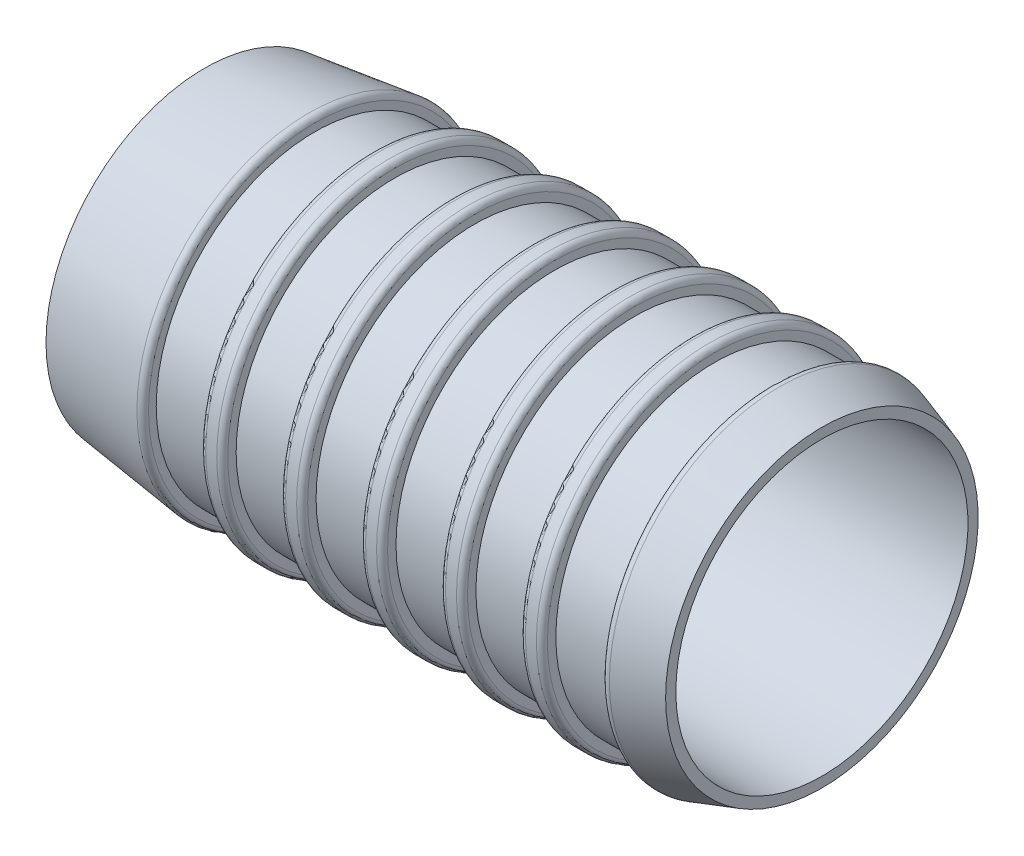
ISO-10303-21;
HEADER;
FILE_DESCRIPTION(('STEP AP214'),'2;1');
FILE_NAME('part.step','',(''),(''),'','','');
FILE_SCHEMA(('AUTOMOTIVE_DESIGN { 1 0 10303 214 1 1 1 1 }'));
ENDSEC;
DATA;
#1=APPLICATION_CONTEXT('core data for automotive mechanical design processes');
#2=APPLICATION_PROTOCOL_DEFINITION('international standard','automotive_design',2000,#1);
#3=PRODUCT_CONTEXT('',#1,'mechanical');
#4=PRODUCT('Part','Part','',(#3));
#5=PRODUCT_RELATED_PRODUCT_CATEGORY('part','',(#4));
#6=PRODUCT_DEFINITION_FORMATION('','',#4);
#7=PRODUCT_DEFINITION_CONTEXT('part definition',#1,'design');
#8=PRODUCT_DEFINITION('design','',#6,#7);
#9=PRODUCT_DEFINITION_SHAPE('','',#8);
#10=(LENGTH_UNIT() NAMED_UNIT(*) SI_UNIT(.MILLI.,.METRE.));
#11=(NAMED_UNIT(*) PLANE_ANGLE_UNIT() SI_UNIT($,.RADIAN.));
#12=(NAMED_UNIT(*) SI_UNIT($,.STERADIAN.) SOLID_ANGLE_UNIT());
#13=UNCERTAINTY_MEASURE_WITH_UNIT(LENGTH_MEASURE(1.E-05),#10,'distance_accuracy_value','');
#14=(GEOMETRIC_REPRESENTATION_CONTEXT(3) GLOBAL_UNCERTAINTY_ASSIGNED_CONTEXT((#13)) GLOBAL_UNIT_ASSIGNED_CONTEXT((#10,
#11,#12)) REPRESENTATION_CONTEXT('',''));
#15=CARTESIAN_POINT('',(0.,0.,0.));
#16=DIRECTION('',(0.,0.,1.));
#17=DIRECTION('',(1.,0.,0.));
#18=AXIS2_PLACEMENT_3D('',#15,#16,#17);
#19=CARTESIAN_POINT('',(-10.0868830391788,26.5,0.));
#20=DIRECTION('',(1.,0.,0.));
#21=DIRECTION('',(0.,0.,-1.));
#22=AXIS2_PLACEMENT_3D('',#19,#20,#21);
#23=PLANE('',#22);
#24=CARTESIAN_POINT('',(-10.0868830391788,0.,0.));
#25=DIRECTION('',(-1.,0.,0.));
#26=DIRECTION('',(0.,0.,1.));
#27=AXIS2_PLACEMENT_3D('',#24,#25,#26);
#28=CIRCLE('',#27,26.5);
#29=CARTESIAN_POINT('',(-10.0868830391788,0.,26.5));
#30=VERTEX_POINT('',#29);
#31=EDGE_CURVE('E150',#30,#30,#28,.T.);
#32=ORIENTED_EDGE('',*,*,#31,.F.);
#33=EDGE_LOOP('',(#32));
#34=FACE_BOUND('',#33,.T.);
#35=CARTESIAN_POINT('',(-10.0868830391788,0.,0.));
#36=DIRECTION('',(-1.,0.,0.));
#37=DIRECTION('',(0.,0.,1.));
#38=AXIS2_PLACEMENT_3D('',#35,#36,#37);
#39=CIRCLE('',#38,28.769640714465);
#40=CARTESIAN_POINT('',(-10.0868830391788,0.,28.769640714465));
#41=VERTEX_POINT('',#40);
#42=EDGE_CURVE('E105',#41,#41,#39,.T.);
#43=ORIENTED_EDGE('',*,*,#42,.T.);
#44=EDGE_LOOP('',(#43));
#45=FACE_BOUND('',#44,.T.);
#46=ADVANCED_FACE('F26',(#34,#45),#23,.F.);
#47=CARTESIAN_POINT('',(9.91311696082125,0.,0.));
#48=DIRECTION('',(1.,0.,0.));
#49=DIRECTION('',(0.,0.,-1.));
#50=AXIS2_PLACEMENT_3D('',#47,#48,#49);
#51=CONICAL_SURFACE('',#50,31.2948133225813,0.125594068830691);
#52=CARTESIAN_POINT('',(8.78785281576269,0.,0.));
#53=DIRECTION('',(-1.,0.,0.));
#54=DIRECTION('',(0.,0.,1.));
#55=AXIS2_PLACEMENT_3D('',#52,#53,#54);
#56=CIRCLE('',#55,31.1527390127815);
#57=CARTESIAN_POINT('',(8.78785281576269,0.,31.1527390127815));
#58=VERTEX_POINT('',#57);
#59=EDGE_CURVE('E32',#58,#58,#56,.T.);
#60=ORIENTED_EDGE('',*,*,#59,.T.);
#61=EDGE_LOOP('',(#60));
#62=FACE_BOUND('',#61,.T.);
#63=ORIENTED_EDGE('',*,*,#42,.F.);
#64=EDGE_LOOP('',(#63));
#65=FACE_BOUND('',#64,.T.);
#66=ADVANCED_FACE('F158',(#62,#65),#51,.T.);
#67=CARTESIAN_POINT('',(9.91311696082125,31.2948133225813,0.));
#68=DIRECTION('',(-1.,0.,0.));
#69=DIRECTION('',(0.,0.,1.));
#70=AXIS2_PLACEMENT_3D('',#67,#68,#69);
#71=PLANE('',#70);
#72=CARTESIAN_POINT('',(9.91311696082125,0.,0.));
#73=DIRECTION('',(-1.,0.,0.));
#74=DIRECTION('',(0.,0.,1.));
#75=AXIS2_PLACEMENT_3D('',#72,#73,#74);
#76=CIRCLE('',#75,30.1606155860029);
#77=CARTESIAN_POINT('',(9.91311696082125,0.,30.1606155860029));
#78=VERTEX_POINT('',#77);
#79=EDGE_CURVE('E10',#78,#78,#76,.F.);
#80=ORIENTED_EDGE('',*,*,#79,.T.);
#81=EDGE_LOOP('',(#80));
#82=FACE_BOUND('',#81,.T.);
#83=CARTESIAN_POINT('',(9.91311696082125,0.,0.));
#84=DIRECTION('',(-1.,0.,0.));
#85=DIRECTION('',(0.,0.,1.));
#86=AXIS2_PLACEMENT_3D('',#83,#84,#85);
#87=CIRCLE('',#86,28.769640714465);
#88=CARTESIAN_POINT('',(9.91311696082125,0.,28.769640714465));
#89=VERTEX_POINT('',#88);
#90=EDGE_CURVE('E108',#89,#89,#87,.T.);
#91=ORIENTED_EDGE('',*,*,#90,.T.);
#92=EDGE_LOOP('',(#91));
#93=FACE_BOUND('',#92,.T.);
#94=ADVANCED_FACE('F162',(#82,#93),#71,.F.);
#95=CARTESIAN_POINT('',(0.,0.,0.));
#96=DIRECTION('',(-1.,0.,0.));
#97=DIRECTION('',(0.,0.,1.));
#98=AXIS2_PLACEMENT_3D('',#95,#96,#97);
#99=CYLINDRICAL_SURFACE('',#98,28.769640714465);
#100=ORIENTED_EDGE('',*,*,#90,.F.);
#101=EDGE_LOOP('',(#100));
#102=FACE_BOUND('',#101,.T.);
#103=CARTESIAN_POINT('',(20.4131169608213,0.,0.));
#104=DIRECTION('',(-1.,0.,0.));
#105=DIRECTION('',(0.,0.,1.));
#106=AXIS2_PLACEMENT_3D('',#103,#104,#105);
#107=CIRCLE('',#106,28.769640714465);
#108=CARTESIAN_POINT('',(20.4131169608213,0.,28.769640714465));
#109=VERTEX_POINT('',#108);
#110=EDGE_CURVE('E111',#109,#109,#107,.T.);
#111=ORIENTED_EDGE('',*,*,#110,.T.);
#112=EDGE_LOOP('',(#111));
#113=FACE_BOUND('',#112,.T.);
#114=ADVANCED_FACE('F167',(#102,#113),#99,.T.);
#115=CARTESIAN_POINT('',(20.4131169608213,28.769640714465,0.));
#116=DIRECTION('',(1.,0.,0.));
#117=DIRECTION('',(0.,0.,-1.));
#118=AXIS2_PLACEMENT_3D('',#115,#116,#117);
#119=PLANE('',#118);
#120=CARTESIAN_POINT('',(20.4131169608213,0.,0.));
#121=DIRECTION('',(1.,0.,0.));
#122=DIRECTION('',(0.,0.,-1.));
#123=AXIS2_PLACEMENT_3D('',#120,#121,#122);
#124=CIRCLE('',#123,30.2948133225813);
#125=CARTESIAN_POINT('',(20.4131169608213,0.,-30.2948133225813));
#126=VERTEX_POINT('',#125);
#127=EDGE_CURVE('E45',#126,#126,#124,.F.);
#128=ORIENTED_EDGE('',*,*,#127,.T.);
#129=EDGE_LOOP('',(#128));
#130=FACE_BOUND('',#129,.T.);
#131=ORIENTED_EDGE('',*,*,#110,.F.);
#132=EDGE_LOOP('',(#131));
#133=FACE_BOUND('',#132,.T.);
#134=ADVANCED_FACE('F172',(#130,#133),#119,.F.);
#135=CARTESIAN_POINT('',(0.,0.,0.));
#136=DIRECTION('',(-1.,0.,0.));
#137=DIRECTION('',(0.,0.,1.));
#138=AXIS2_PLACEMENT_3D('',#135,#136,#137);
#139=CYLINDRICAL_SURFACE('',#138,31.2948133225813);
#140=CARTESIAN_POINT('',(23.4131169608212,0.,0.));
#141=DIRECTION('',(-1.,0.,0.));
#142=DIRECTION('',(0.,0.,1.));
#143=AXIS2_PLACEMENT_3D('',#140,#141,#142);
#144=CIRCLE('',#143,31.2948133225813);
#145=CARTESIAN_POINT('',(23.4131169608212,0.,31.2948133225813));
#146=VERTEX_POINT('',#145);
#147=EDGE_CURVE('E51',#146,#146,#144,.T.);
#148=ORIENTED_EDGE('',*,*,#147,.T.);
#149=EDGE_LOOP('',(#148));
#150=FACE_BOUND('',#149,.T.);
#151=CARTESIAN_POINT('',(21.4131169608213,0.,0.));
#152=DIRECTION('',(1.,0.,0.));
#153=DIRECTION('',(0.,0.,-1.));
#154=AXIS2_PLACEMENT_3D('',#151,#152,#153);
#155=CIRCLE('',#154,31.2948133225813);
#156=CARTESIAN_POINT('',(21.4131169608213,0.,-31.2948133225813));
#157=VERTEX_POINT('',#156);
#158=EDGE_CURVE('E54',#157,#157,#155,.T.);
#159=ORIENTED_EDGE('',*,*,#158,.T.);
#160=EDGE_LOOP('',(#159));
#161=FACE_BOUND('',#160,.T.);
#162=ADVANCED_FACE('F176',(#150,#161),#139,.T.);
#163=CARTESIAN_POINT('',(24.4131169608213,31.2948133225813,0.));
#164=DIRECTION('',(-1.,0.,0.));
#165=DIRECTION('',(0.,0.,1.));
#166=AXIS2_PLACEMENT_3D('',#163,#164,#165);
#167=PLANE('',#166);
#168=CARTESIAN_POINT('',(24.4131169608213,0.,0.));
#169=DIRECTION('',(-1.,0.,0.));
#170=DIRECTION('',(0.,0.,1.));
#171=AXIS2_PLACEMENT_3D('',#168,#169,#170);
#172=CIRCLE('',#171,30.2948133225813);
#173=CARTESIAN_POINT('',(24.4131169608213,0.,30.2948133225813));
#174=VERTEX_POINT('',#173);
#175=EDGE_CURVE('E48',#174,#174,#172,.F.);
#176=ORIENTED_EDGE('',*,*,#175,.T.);
#177=EDGE_LOOP('',(#176));
#178=FACE_BOUND('',#177,.T.);
#179=CARTESIAN_POINT('',(24.4131169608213,0.,0.));
#180=DIRECTION('',(-1.,0.,0.));
#181=DIRECTION('',(0.,0.,1.));
#182=AXIS2_PLACEMENT_3D('',#179,#180,#181);
#183=CIRCLE('',#182,28.769640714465);
#184=CARTESIAN_POINT('',(24.4131169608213,0.,28.769640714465));
#185=VERTEX_POINT('',#184);
#186=EDGE_CURVE('E114',#185,#185,#183,.T.);
#187=ORIENTED_EDGE('',*,*,#186,.T.);
#188=EDGE_LOOP('',(#187));
#189=FACE_BOUND('',#188,.T.);
#190=ADVANCED_FACE('F180',(#178,#189),#167,.F.);
#191=CARTESIAN_POINT('',(0.,0.,0.));
#192=DIRECTION('',(-1.,0.,0.));
#193=DIRECTION('',(0.,0.,1.));
#194=AXIS2_PLACEMENT_3D('',#191,#192,#193);
#195=CYLINDRICAL_SURFACE('',#194,28.769640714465);
#196=ORIENTED_EDGE('',*,*,#186,.F.);
#197=EDGE_LOOP('',(#196));
#198=FACE_BOUND('',#197,.T.);
#199=CARTESIAN_POINT('',(34.9131169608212,0.,0.));
#200=DIRECTION('',(-1.,0.,0.));
#201=DIRECTION('',(0.,0.,1.));
#202=AXIS2_PLACEMENT_3D('',#199,#200,#201);
#203=CIRCLE('',#202,28.769640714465);
#204=CARTESIAN_POINT('',(34.9131169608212,0.,28.769640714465));
#205=VERTEX_POINT('',#204);
#206=EDGE_CURVE('E117',#205,#205,#203,.T.);
#207=ORIENTED_EDGE('',*,*,#206,.T.);
#208=EDGE_LOOP('',(#207));
#209=FACE_BOUND('',#208,.T.);
#210=ADVANCED_FACE('F184',(#198,#209),#195,.T.);
#211=CARTESIAN_POINT('',(34.9131169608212,28.769640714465,0.));
#212=DIRECTION('',(1.,0.,0.));
#213=DIRECTION('',(0.,0.,-1.));
#214=AXIS2_PLACEMENT_3D('',#211,#212,#213);
#215=PLANE('',#214);
#216=CARTESIAN_POINT('',(34.9131169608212,0.,0.));
#217=DIRECTION('',(1.,0.,0.));
#218=DIRECTION('',(0.,0.,-1.));
#219=AXIS2_PLACEMENT_3D('',#216,#217,#218);
#220=CIRCLE('',#219,30.2948133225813);
#221=CARTESIAN_POINT('',(34.9131169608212,0.,-30.2948133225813));
#222=VERTEX_POINT('',#221);
#223=EDGE_CURVE('E57',#222,#222,#220,.F.);
#224=ORIENTED_EDGE('',*,*,#223,.T.);
#225=EDGE_LOOP('',(#224));
#226=FACE_BOUND('',#225,.T.);
#227=ORIENTED_EDGE('',*,*,#206,.F.);
#228=EDGE_LOOP('',(#227));
#229=FACE_BOUND('',#228,.T.);
#230=ADVANCED_FACE('F188',(#226,#229),#215,.F.);
#231=CARTESIAN_POINT('',(0.,0.,0.));
#232=DIRECTION('',(-1.,0.,0.));
#233=DIRECTION('',(0.,0.,1.));
#234=AXIS2_PLACEMENT_3D('',#231,#232,#233);
#235=CYLINDRICAL_SURFACE('',#234,31.2948133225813);
#236=CARTESIAN_POINT('',(37.9131169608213,0.,0.));
#237=DIRECTION('',(-1.,0.,0.));
#238=DIRECTION('',(0.,0.,1.));
#239=AXIS2_PLACEMENT_3D('',#236,#237,#238);
#240=CIRCLE('',#239,31.2948133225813);
#241=CARTESIAN_POINT('',(37.9131169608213,0.,31.2948133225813));
#242=VERTEX_POINT('',#241);
#243=EDGE_CURVE('E63',#242,#242,#240,.T.);
#244=ORIENTED_EDGE('',*,*,#243,.T.);
#245=EDGE_LOOP('',(#244));
#246=FACE_BOUND('',#245,.T.);
#247=CARTESIAN_POINT('',(35.9131169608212,0.,0.));
#248=DIRECTION('',(1.,0.,0.));
#249=DIRECTION('',(0.,0.,-1.));
#250=AXIS2_PLACEMENT_3D('',#247,#248,#249);
#251=CIRCLE('',#250,31.2948133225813);
#252=CARTESIAN_POINT('',(35.9131169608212,0.,-31.2948133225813));
#253=VERTEX_POINT('',#252);
#254=EDGE_CURVE('E66',#253,#253,#251,.T.);
#255=ORIENTED_EDGE('',*,*,#254,.T.);
#256=EDGE_LOOP('',(#255));
#257=FACE_BOUND('',#256,.T.);
#258=ADVANCED_FACE('F192',(#246,#257),#235,.T.);
#259=CARTESIAN_POINT('',(38.9131169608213,31.2948133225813,0.));
#260=DIRECTION('',(-1.,0.,0.));
#261=DIRECTION('',(0.,0.,1.));
#262=AXIS2_PLACEMENT_3D('',#259,#260,#261);
#263=PLANE('',#262);
#264=CARTESIAN_POINT('',(38.9131169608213,0.,0.));
#265=DIRECTION('',(-1.,0.,0.));
#266=DIRECTION('',(0.,0.,1.));
#267=AXIS2_PLACEMENT_3D('',#264,#265,#266);
#268=CIRCLE('',#267,30.2948133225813);
#269=CARTESIAN_POINT('',(38.9131169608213,0.,30.2948133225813));
#270=VERTEX_POINT('',#269);
#271=EDGE_CURVE('E60',#270,#270,#268,.F.);
#272=ORIENTED_EDGE('',*,*,#271,.T.);
#273=EDGE_LOOP('',(#272));
#274=FACE_BOUND('',#273,.T.);
#275=CARTESIAN_POINT('',(38.9131169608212,0.,0.));
#276=DIRECTION('',(-1.,0.,0.));
#277=DIRECTION('',(0.,0.,1.));
#278=AXIS2_PLACEMENT_3D('',#275,#276,#277);
#279=CIRCLE('',#278,28.769640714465);
#280=CARTESIAN_POINT('',(38.9131169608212,0.,28.769640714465));
#281=VERTEX_POINT('',#280);
#282=EDGE_CURVE('E120',#281,#281,#279,.T.);
#283=ORIENTED_EDGE('',*,*,#282,.T.);
#284=EDGE_LOOP('',(#283));
#285=FACE_BOUND('',#284,.T.);
#286=ADVANCED_FACE('F196',(#274,#285),#263,.F.);
#287=CARTESIAN_POINT('',(0.,0.,0.));
#288=DIRECTION('',(-1.,0.,0.));
#289=DIRECTION('',(0.,0.,1.));
#290=AXIS2_PLACEMENT_3D('',#287,#288,#289);
#291=CYLINDRICAL_SURFACE('',#290,28.769640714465);
#292=ORIENTED_EDGE('',*,*,#282,.F.);
#293=EDGE_LOOP('',(#292));
#294=FACE_BOUND('',#293,.T.);
#295=CARTESIAN_POINT('',(49.4131169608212,0.,0.));
#296=DIRECTION('',(-1.,0.,0.));
#297=DIRECTION('',(0.,0.,1.));
#298=AXIS2_PLACEMENT_3D('',#295,#296,#297);
#299=CIRCLE('',#298,28.769640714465);
#300=CARTESIAN_POINT('',(49.4131169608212,0.,28.769640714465));
#301=VERTEX_POINT('',#300);
#302=EDGE_CURVE('E123',#301,#301,#299,.T.);
#303=ORIENTED_EDGE('',*,*,#302,.T.);
#304=EDGE_LOOP('',(#303));
#305=FACE_BOUND('',#304,.T.);
#306=ADVANCED_FACE('F200',(#294,#305),#291,.T.);
#307=CARTESIAN_POINT('',(49.4131169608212,28.769640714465,0.));
#308=DIRECTION('',(1.,0.,0.));
#309=DIRECTION('',(0.,0.,-1.));
#310=AXIS2_PLACEMENT_3D('',#307,#308,#309);
#311=PLANE('',#310);
#312=CARTESIAN_POINT('',(49.4131169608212,0.,0.));
#313=DIRECTION('',(1.,0.,0.));
#314=DIRECTION('',(0.,0.,-1.));
#315=AXIS2_PLACEMENT_3D('',#312,#313,#314);
#316=CIRCLE('',#315,30.2948133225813);
#317=CARTESIAN_POINT('',(49.4131169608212,0.,-30.2948133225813));
#318=VERTEX_POINT('',#317);
#319=EDGE_CURVE('E69',#318,#318,#316,.F.);
#320=ORIENTED_EDGE('',*,*,#319,.T.);
#321=EDGE_LOOP('',(#320));
#322=FACE_BOUND('',#321,.T.);
#323=ORIENTED_EDGE('',*,*,#302,.F.);
#324=EDGE_LOOP('',(#323));
#325=FACE_BOUND('',#324,.T.);
#326=ADVANCED_FACE('F204',(#322,#325),#311,.F.);
#327=CARTESIAN_POINT('',(0.,0.,0.));
#328=DIRECTION('',(-1.,0.,0.));
#329=DIRECTION('',(0.,0.,1.));
#330=AXIS2_PLACEMENT_3D('',#327,#328,#329);
#331=CYLINDRICAL_SURFACE('',#330,31.2948133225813);
#332=CARTESIAN_POINT('',(52.4131169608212,0.,0.));
#333=DIRECTION('',(-1.,0.,0.));
#334=DIRECTION('',(0.,0.,1.));
#335=AXIS2_PLACEMENT_3D('',#332,#333,#334);
#336=CIRCLE('',#335,31.2948133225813);
#337=CARTESIAN_POINT('',(52.4131169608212,0.,31.2948133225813));
#338=VERTEX_POINT('',#337);
#339=EDGE_CURVE('E75',#338,#338,#336,.T.);
#340=ORIENTED_EDGE('',*,*,#339,.T.);
#341=EDGE_LOOP('',(#340));
#342=FACE_BOUND('',#341,.T.);
#343=CARTESIAN_POINT('',(50.4131169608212,0.,0.));
#344=DIRECTION('',(1.,0.,0.));
#345=DIRECTION('',(0.,0.,-1.));
#346=AXIS2_PLACEMENT_3D('',#343,#344,#345);
#347=CIRCLE('',#346,31.2948133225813);
#348=CARTESIAN_POINT('',(50.4131169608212,0.,-31.2948133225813));
#349=VERTEX_POINT('',#348);
#350=EDGE_CURVE('E78',#349,#349,#347,.T.);
#351=ORIENTED_EDGE('',*,*,#350,.T.);
#352=EDGE_LOOP('',(#351));
#353=FACE_BOUND('',#352,.T.);
#354=ADVANCED_FACE('F208',(#342,#353),#331,.T.);
#355=CARTESIAN_POINT('',(53.4131169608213,31.2948133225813,0.));
#356=DIRECTION('',(-1.,0.,0.));
#357=DIRECTION('',(0.,0.,1.));
#358=AXIS2_PLACEMENT_3D('',#355,#356,#357);
#359=PLANE('',#358);
#360=CARTESIAN_POINT('',(53.4131169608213,0.,0.));
#361=DIRECTION('',(-1.,0.,0.));
#362=DIRECTION('',(0.,0.,1.));
#363=AXIS2_PLACEMENT_3D('',#360,#361,#362);
#364=CIRCLE('',#363,30.2948133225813);
#365=CARTESIAN_POINT('',(53.4131169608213,0.,30.2948133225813));
#366=VERTEX_POINT('',#365);
#367=EDGE_CURVE('E72',#366,#366,#364,.F.);
#368=ORIENTED_EDGE('',*,*,#367,.T.);
#369=EDGE_LOOP('',(#368));
#370=FACE_BOUND('',#369,.T.);
#371=CARTESIAN_POINT('',(53.4131169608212,0.,0.));
#372=DIRECTION('',(-1.,0.,0.));
#373=DIRECTION('',(0.,0.,1.));
#374=AXIS2_PLACEMENT_3D('',#371,#372,#373);
#375=CIRCLE('',#374,28.769640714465);
#376=CARTESIAN_POINT('',(53.4131169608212,0.,28.769640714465));
#377=VERTEX_POINT('',#376);
#378=EDGE_CURVE('E126',#377,#377,#375,.T.);
#379=ORIENTED_EDGE('',*,*,#378,.T.);
#380=EDGE_LOOP('',(#379));
#381=FACE_BOUND('',#380,.T.);
#382=ADVANCED_FACE('F212',(#370,#381),#359,.F.);
#383=CARTESIAN_POINT('',(0.,0.,0.));
#384=DIRECTION('',(-1.,0.,0.));
#385=DIRECTION('',(0.,0.,1.));
#386=AXIS2_PLACEMENT_3D('',#383,#384,#385);
#387=CYLINDRICAL_SURFACE('',#386,28.769640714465);
#388=ORIENTED_EDGE('',*,*,#378,.F.);
#389=EDGE_LOOP('',(#388));
#390=FACE_BOUND('',#389,.T.);
#391=CARTESIAN_POINT('',(63.9131169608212,0.,0.));
#392=DIRECTION('',(-1.,0.,0.));
#393=DIRECTION('',(0.,0.,1.));
#394=AXIS2_PLACEMENT_3D('',#391,#392,#393);
#395=CIRCLE('',#394,28.769640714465);
#396=CARTESIAN_POINT('',(63.9131169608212,0.,28.769640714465));
#397=VERTEX_POINT('',#396);
#398=EDGE_CURVE('E129',#397,#397,#395,.T.);
#399=ORIENTED_EDGE('',*,*,#398,.T.);
#400=EDGE_LOOP('',(#399));
#401=FACE_BOUND('',#400,.T.);
#402=ADVANCED_FACE('F216',(#390,#401),#387,.T.);
#403=CARTESIAN_POINT('',(63.9131169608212,28.769640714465,0.));
#404=DIRECTION('',(1.,0.,0.));
#405=DIRECTION('',(0.,0.,-1.));
#406=AXIS2_PLACEMENT_3D('',#403,#404,#405);
#407=PLANE('',#406);
#408=CARTESIAN_POINT('',(63.9131169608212,0.,0.));
#409=DIRECTION('',(1.,0.,0.));
#410=DIRECTION('',(0.,0.,-1.));
#411=AXIS2_PLACEMENT_3D('',#408,#409,#410);
#412=CIRCLE('',#411,30.2948133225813);
#413=CARTESIAN_POINT('',(63.9131169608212,0.,-30.2948133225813));
#414=VERTEX_POINT('',#413);
#415=EDGE_CURVE('E81',#414,#414,#412,.F.);
#416=ORIENTED_EDGE('',*,*,#415,.T.);
#417=EDGE_LOOP('',(#416));
#418=FACE_BOUND('',#417,.T.);
#419=ORIENTED_EDGE('',*,*,#398,.F.);
#420=EDGE_LOOP('',(#419));
#421=FACE_BOUND('',#420,.T.);
#422=ADVANCED_FACE('F220',(#418,#421),#407,.F.);
#423=CARTESIAN_POINT('',(0.,0.,0.));
#424=DIRECTION('',(-1.,0.,0.));
#425=DIRECTION('',(0.,0.,1.));
#426=AXIS2_PLACEMENT_3D('',#423,#424,#425);
#427=CYLINDRICAL_SURFACE('',#426,31.2948133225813);
#428=CARTESIAN_POINT('',(66.9131169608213,0.,0.));
#429=DIRECTION('',(-1.,0.,0.));
#430=DIRECTION('',(0.,0.,1.));
#431=AXIS2_PLACEMENT_3D('',#428,#429,#430);
#432=CIRCLE('',#431,31.2948133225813);
#433=CARTESIAN_POINT('',(66.9131169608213,0.,31.2948133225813));
#434=VERTEX_POINT('',#433);
#435=EDGE_CURVE('E87',#434,#434,#432,.T.);
#436=ORIENTED_EDGE('',*,*,#435,.T.);
#437=EDGE_LOOP('',(#436));
#438=FACE_BOUND('',#437,.T.);
#439=CARTESIAN_POINT('',(64.9131169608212,0.,0.));
#440=DIRECTION('',(1.,0.,0.));
#441=DIRECTION('',(0.,0.,-1.));
#442=AXIS2_PLACEMENT_3D('',#439,#440,#441);
#443=CIRCLE('',#442,31.2948133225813);
#444=CARTESIAN_POINT('',(64.9131169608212,0.,-31.2948133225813));
#445=VERTEX_POINT('',#444);
#446=EDGE_CURVE('E90',#445,#445,#443,.T.);
#447=ORIENTED_EDGE('',*,*,#446,.T.);
#448=EDGE_LOOP('',(#447));
#449=FACE_BOUND('',#448,.T.);
#450=ADVANCED_FACE('F224',(#438,#449),#427,.T.);
#451=CARTESIAN_POINT('',(67.9131169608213,31.2948133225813,0.));
#452=DIRECTION('',(-1.,0.,0.));
#453=DIRECTION('',(0.,0.,1.));
#454=AXIS2_PLACEMENT_3D('',#451,#452,#453);
#455=PLANE('',#454);
#456=CARTESIAN_POINT('',(67.9131169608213,0.,0.));
#457=DIRECTION('',(-1.,0.,0.));
#458=DIRECTION('',(0.,0.,1.));
#459=AXIS2_PLACEMENT_3D('',#456,#457,#458);
#460=CIRCLE('',#459,30.2948133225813);
#461=CARTESIAN_POINT('',(67.9131169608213,0.,30.2948133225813));
#462=VERTEX_POINT('',#461);
#463=EDGE_CURVE('E84',#462,#462,#460,.F.);
#464=ORIENTED_EDGE('',*,*,#463,.T.);
#465=EDGE_LOOP('',(#464));
#466=FACE_BOUND('',#465,.T.);
#467=CARTESIAN_POINT('',(67.9131169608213,0.,0.));
#468=DIRECTION('',(-1.,0.,0.));
#469=DIRECTION('',(0.,0.,1.));
#470=AXIS2_PLACEMENT_3D('',#467,#468,#469);
#471=CIRCLE('',#470,28.7696407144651);
#472=CARTESIAN_POINT('',(67.9131169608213,0.,28.7696407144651));
#473=VERTEX_POINT('',#472);
#474=EDGE_CURVE('E132',#473,#473,#471,.T.);
#475=ORIENTED_EDGE('',*,*,#474,.T.);
#476=EDGE_LOOP('',(#475));
#477=FACE_BOUND('',#476,.T.);
#478=ADVANCED_FACE('F228',(#466,#477),#455,.F.);
#479=CARTESIAN_POINT('',(0.,0.,0.));
#480=DIRECTION('',(-1.,0.,0.));
#481=DIRECTION('',(0.,0.,1.));
#482=AXIS2_PLACEMENT_3D('',#479,#480,#481);
#483=CYLINDRICAL_SURFACE('',#482,28.7696407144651);
#484=ORIENTED_EDGE('',*,*,#474,.F.);
#485=EDGE_LOOP('',(#484));
#486=FACE_BOUND('',#485,.T.);
#487=CARTESIAN_POINT('',(78.4131169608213,0.,0.));
#488=DIRECTION('',(-1.,0.,0.));
#489=DIRECTION('',(0.,0.,1.));
#490=AXIS2_PLACEMENT_3D('',#487,#488,#489);
#491=CIRCLE('',#490,28.7696407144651);
#492=CARTESIAN_POINT('',(78.4131169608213,0.,28.7696407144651));
#493=VERTEX_POINT('',#492);
#494=EDGE_CURVE('E135',#493,#493,#491,.T.);
#495=ORIENTED_EDGE('',*,*,#494,.T.);
#496=EDGE_LOOP('',(#495));
#497=FACE_BOUND('',#496,.T.);
#498=ADVANCED_FACE('F232',(#486,#497),#483,.T.);
#499=CARTESIAN_POINT('',(78.4131169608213,28.7696407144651,0.));
#500=DIRECTION('',(1.,0.,0.));
#501=DIRECTION('',(0.,0.,-1.));
#502=AXIS2_PLACEMENT_3D('',#499,#500,#501);
#503=PLANE('',#502);
#504=CARTESIAN_POINT('',(78.4131169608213,0.,0.));
#505=DIRECTION('',(1.,0.,0.));
#506=DIRECTION('',(0.,0.,-1.));
#507=AXIS2_PLACEMENT_3D('',#504,#505,#506);
#508=CIRCLE('',#507,30.2948133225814);
#509=CARTESIAN_POINT('',(78.4131169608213,0.,-30.2948133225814));
#510=VERTEX_POINT('',#509);
#511=EDGE_CURVE('E93',#510,#510,#508,.F.);
#512=ORIENTED_EDGE('',*,*,#511,.T.);
#513=EDGE_LOOP('',(#512));
#514=FACE_BOUND('',#513,.T.);
#515=ORIENTED_EDGE('',*,*,#494,.F.);
#516=EDGE_LOOP('',(#515));
#517=FACE_BOUND('',#516,.T.);
#518=ADVANCED_FACE('F236',(#514,#517),#503,.F.);
#519=CARTESIAN_POINT('',(0.,0.,0.));
#520=DIRECTION('',(-1.,0.,0.));
#521=DIRECTION('',(0.,0.,1.));
#522=AXIS2_PLACEMENT_3D('',#519,#520,#521);
#523=CYLINDRICAL_SURFACE('',#522,31.2948133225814);
#524=CARTESIAN_POINT('',(81.4131169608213,0.,0.));
#525=DIRECTION('',(-1.,0.,0.));
#526=DIRECTION('',(0.,0.,1.));
#527=AXIS2_PLACEMENT_3D('',#524,#525,#526);
#528=CIRCLE('',#527,31.2948133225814);
#529=CARTESIAN_POINT('',(81.4131169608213,0.,31.2948133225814));
#530=VERTEX_POINT('',#529);
#531=EDGE_CURVE('E99',#530,#530,#528,.T.);
#532=ORIENTED_EDGE('',*,*,#531,.T.);
#533=EDGE_LOOP('',(#532));
#534=FACE_BOUND('',#533,.T.);
#535=CARTESIAN_POINT('',(79.4131169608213,0.,0.));
#536=DIRECTION('',(1.,0.,0.));
#537=DIRECTION('',(0.,0.,-1.));
#538=AXIS2_PLACEMENT_3D('',#535,#536,#537);
#539=CIRCLE('',#538,31.2948133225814);
#540=CARTESIAN_POINT('',(79.4131169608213,0.,-31.2948133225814));
#541=VERTEX_POINT('',#540);
#542=EDGE_CURVE('E102',#541,#541,#539,.T.);
#543=ORIENTED_EDGE('',*,*,#542,.T.);
#544=EDGE_LOOP('',(#543));
#545=FACE_BOUND('',#544,.T.);
#546=ADVANCED_FACE('F240',(#534,#545),#523,.T.);
#547=CARTESIAN_POINT('',(82.4131169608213,31.2948133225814,0.));
#548=DIRECTION('',(-1.,0.,0.));
#549=DIRECTION('',(0.,0.,1.));
#550=AXIS2_PLACEMENT_3D('',#547,#548,#549);
#551=PLANE('',#550);
#552=CARTESIAN_POINT('',(82.4131169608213,0.,0.));
#553=DIRECTION('',(-1.,0.,0.));
#554=DIRECTION('',(0.,0.,1.));
#555=AXIS2_PLACEMENT_3D('',#552,#553,#554);
#556=CIRCLE('',#555,30.2948133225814);
#557=CARTESIAN_POINT('',(82.4131169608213,0.,30.2948133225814));
#558=VERTEX_POINT('',#557);
#559=EDGE_CURVE('E96',#558,#558,#556,.F.);
#560=ORIENTED_EDGE('',*,*,#559,.T.);
#561=EDGE_LOOP('',(#560));
#562=FACE_BOUND('',#561,.T.);
#563=CARTESIAN_POINT('',(82.4131169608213,0.,0.));
#564=DIRECTION('',(-1.,0.,0.));
#565=DIRECTION('',(0.,0.,1.));
#566=AXIS2_PLACEMENT_3D('',#563,#564,#565);
#567=CIRCLE('',#566,28.7696407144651);
#568=CARTESIAN_POINT('',(82.4131169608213,0.,28.7696407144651));
#569=VERTEX_POINT('',#568);
#570=EDGE_CURVE('E138',#569,#569,#567,.T.);
#571=ORIENTED_EDGE('',*,*,#570,.T.);
#572=EDGE_LOOP('',(#571));
#573=FACE_BOUND('',#572,.T.);
#574=ADVANCED_FACE('F244',(#562,#573),#551,.F.);
#575=CARTESIAN_POINT('',(0.,0.,0.));
#576=DIRECTION('',(-1.,0.,0.));
#577=DIRECTION('',(0.,0.,1.));
#578=AXIS2_PLACEMENT_3D('',#575,#576,#577);
#579=CYLINDRICAL_SURFACE('',#578,28.7696407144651);
#580=ORIENTED_EDGE('',*,*,#570,.F.);
#581=EDGE_LOOP('',(#580));
#582=FACE_BOUND('',#581,.T.);
#583=CARTESIAN_POINT('',(92.9131169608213,0.,0.));
#584=DIRECTION('',(-1.,0.,0.));
#585=DIRECTION('',(0.,0.,1.));
#586=AXIS2_PLACEMENT_3D('',#583,#584,#585);
#587=CIRCLE('',#586,28.7696407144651);
#588=CARTESIAN_POINT('',(92.9131169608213,0.,28.7696407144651));
#589=VERTEX_POINT('',#588);
#590=EDGE_CURVE('E141',#589,#589,#587,.T.);
#591=ORIENTED_EDGE('',*,*,#590,.T.);
#592=EDGE_LOOP('',(#591));
#593=FACE_BOUND('',#592,.T.);
#594=ADVANCED_FACE('F248',(#582,#593),#579,.T.);
#595=CARTESIAN_POINT('',(92.9131169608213,28.7696407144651,0.));
#596=DIRECTION('',(1.,0.,0.));
#597=DIRECTION('',(0.,0.,-1.));
#598=AXIS2_PLACEMENT_3D('',#595,#596,#597);
#599=PLANE('',#598);
#600=CARTESIAN_POINT('',(92.9131169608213,0.,0.));
#601=DIRECTION('',(1.,0.,0.));
#602=DIRECTION('',(0.,0.,-1.));
#603=AXIS2_PLACEMENT_3D('',#600,#601,#602);
#604=CIRCLE('',#603,29.9158665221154);
#605=CARTESIAN_POINT('',(92.9131169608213,0.,-29.9158665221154));
#606=VERTEX_POINT('',#605);
#607=EDGE_CURVE('E40',#606,#606,#604,.F.);
#608=ORIENTED_EDGE('',*,*,#607,.T.);
#609=EDGE_LOOP('',(#608));
#610=FACE_BOUND('',#609,.T.);
#611=ORIENTED_EDGE('',*,*,#590,.F.);
#612=EDGE_LOOP('',(#611));
#613=FACE_BOUND('',#612,.T.);
#614=ADVANCED_FACE('F252',(#610,#613),#599,.F.);
#615=CARTESIAN_POINT('',(101.913116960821,0.,0.));
#616=DIRECTION('',(-1.,0.,0.));
#617=DIRECTION('',(0.,0.,1.));
#618=AXIS2_PLACEMENT_3D('',#615,#616,#617);
#619=CONICAL_SURFACE('',#618,28.3529128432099,0.315929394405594);
#620=CARTESIAN_POINT('',(94.2238169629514,0.,0.));
#621=DIRECTION('',(1.,0.,0.));
#622=DIRECTION('',(0.,0.,-1.));
#623=AXIS2_PLACEMENT_3D('',#620,#621,#622);
#624=CIRCLE('',#623,30.8663745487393);
#625=CARTESIAN_POINT('',(94.2238169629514,0.,-30.8663745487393));
#626=VERTEX_POINT('',#625);
#627=EDGE_CURVE('E36',#626,#626,#624,.T.);
#628=ORIENTED_EDGE('',*,*,#627,.T.);
#629=EDGE_LOOP('',(#628));
#630=FACE_BOUND('',#629,.T.);
#631=CARTESIAN_POINT('',(101.913116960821,0.,0.));
#632=DIRECTION('',(-1.,0.,0.));
#633=DIRECTION('',(0.,0.,1.));
#634=AXIS2_PLACEMENT_3D('',#631,#632,#633);
#635=CIRCLE('',#634,28.3529128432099);
#636=CARTESIAN_POINT('',(101.913116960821,0.,28.3529128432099));
#637=VERTEX_POINT('',#636);
#638=EDGE_CURVE('E144',#637,#637,#635,.T.);
#639=ORIENTED_EDGE('',*,*,#638,.T.);
#640=EDGE_LOOP('',(#639));
#641=FACE_BOUND('',#640,.T.);
#642=ADVANCED_FACE('F256',(#630,#641),#619,.T.);
#643=CARTESIAN_POINT('',(101.913116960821,28.3529128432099,0.));
#644=DIRECTION('',(-1.,0.,0.));
#645=DIRECTION('',(0.,0.,1.));
#646=AXIS2_PLACEMENT_3D('',#643,#644,#645);
#647=PLANE('',#646);
#648=ORIENTED_EDGE('',*,*,#638,.F.);
#649=EDGE_LOOP('',(#648));
#650=FACE_BOUND('',#649,.T.);
#651=CARTESIAN_POINT('',(101.913116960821,0.,0.));
#652=DIRECTION('',(-1.,0.,0.));
#653=DIRECTION('',(0.,0.,1.));
#654=AXIS2_PLACEMENT_3D('',#651,#652,#653);
#655=CIRCLE('',#654,26.5);
#656=CARTESIAN_POINT('',(101.913116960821,0.,26.5));
#657=VERTEX_POINT('',#656);
#658=EDGE_CURVE('E147',#657,#657,#655,.T.);
#659=ORIENTED_EDGE('',*,*,#658,.T.);
#660=EDGE_LOOP('',(#659));
#661=FACE_BOUND('',#660,.T.);
#662=ADVANCED_FACE('F260',(#650,#661),#647,.F.);
#663=CARTESIAN_POINT('',(0.,0.,0.));
#664=DIRECTION('',(-1.,0.,0.));
#665=DIRECTION('',(0.,0.,1.));
#666=AXIS2_PLACEMENT_3D('',#663,#664,#665);
#667=CYLINDRICAL_SURFACE('',#666,26.5);
#668=ORIENTED_EDGE('',*,*,#658,.F.);
#669=EDGE_LOOP('',(#668));
#670=FACE_BOUND('',#669,.T.);
#671=ORIENTED_EDGE('',*,*,#31,.T.);
#672=EDGE_LOOP('',(#671));
#673=FACE_BOUND('',#672,.T.);
#674=ADVANCED_FACE('F154',(#670,#673),#667,.F.);
#675=CARTESIAN_POINT('',(81.4131169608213,0.,0.));
#676=DIRECTION('',(-1.,0.,0.));
#677=DIRECTION('',(0.,0.,1.));
#678=AXIS2_PLACEMENT_3D('',#675,#676,#677);
#679=TOROIDAL_SURFACE('',#678,30.2948133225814,1.);
#680=ORIENTED_EDGE('',*,*,#559,.F.);
#681=EDGE_LOOP('',(#680));
#682=FACE_BOUND('',#681,.T.);
#683=ORIENTED_EDGE('',*,*,#531,.F.);
#684=EDGE_LOOP('',(#683));
#685=FACE_BOUND('',#684,.T.);
#686=ADVANCED_FACE('F266',(#682,#685),#679,.T.);
#687=CARTESIAN_POINT('',(79.4131169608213,0.,0.));
#688=DIRECTION('',(1.,0.,0.));
#689=DIRECTION('',(0.,0.,-1.));
#690=AXIS2_PLACEMENT_3D('',#687,#688,#689);
#691=TOROIDAL_SURFACE('',#690,30.2948133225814,1.);
#692=ORIENTED_EDGE('',*,*,#542,.F.);
#693=EDGE_LOOP('',(#692));
#694=FACE_BOUND('',#693,.T.);
#695=ORIENTED_EDGE('',*,*,#511,.F.);
#696=EDGE_LOOP('',(#695));
#697=FACE_BOUND('',#696,.T.);
#698=ADVANCED_FACE('F270',(#694,#697),#691,.T.);
#699=CARTESIAN_POINT('',(66.9131169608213,0.,0.));
#700=DIRECTION('',(-1.,0.,0.));
#701=DIRECTION('',(0.,0.,1.));
#702=AXIS2_PLACEMENT_3D('',#699,#700,#701);
#703=TOROIDAL_SURFACE('',#702,30.2948133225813,1.);
#704=ORIENTED_EDGE('',*,*,#463,.F.);
#705=EDGE_LOOP('',(#704));
#706=FACE_BOUND('',#705,.T.);
#707=ORIENTED_EDGE('',*,*,#435,.F.);
#708=EDGE_LOOP('',(#707));
#709=FACE_BOUND('',#708,.T.);
#710=ADVANCED_FACE('F274',(#706,#709),#703,.T.);
#711=CARTESIAN_POINT('',(64.9131169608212,0.,0.));
#712=DIRECTION('',(1.,0.,0.));
#713=DIRECTION('',(0.,0.,-1.));
#714=AXIS2_PLACEMENT_3D('',#711,#712,#713);
#715=TOROIDAL_SURFACE('',#714,30.2948133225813,1.);
#716=ORIENTED_EDGE('',*,*,#446,.F.);
#717=EDGE_LOOP('',(#716));
#718=FACE_BOUND('',#717,.T.);
#719=ORIENTED_EDGE('',*,*,#415,.F.);
#720=EDGE_LOOP('',(#719));
#721=FACE_BOUND('',#720,.T.);
#722=ADVANCED_FACE('F278',(#718,#721),#715,.T.);
#723=CARTESIAN_POINT('',(52.4131169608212,0.,0.));
#724=DIRECTION('',(-1.,0.,0.));
#725=DIRECTION('',(0.,0.,1.));
#726=AXIS2_PLACEMENT_3D('',#723,#724,#725);
#727=TOROIDAL_SURFACE('',#726,30.2948133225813,1.);
#728=ORIENTED_EDGE('',*,*,#367,.F.);
#729=EDGE_LOOP('',(#728));
#730=FACE_BOUND('',#729,.T.);
#731=ORIENTED_EDGE('',*,*,#339,.F.);
#732=EDGE_LOOP('',(#731));
#733=FACE_BOUND('',#732,.T.);
#734=ADVANCED_FACE('F282',(#730,#733),#727,.T.);
#735=CARTESIAN_POINT('',(50.4131169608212,0.,0.));
#736=DIRECTION('',(1.,0.,0.));
#737=DIRECTION('',(0.,0.,-1.));
#738=AXIS2_PLACEMENT_3D('',#735,#736,#737);
#739=TOROIDAL_SURFACE('',#738,30.2948133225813,1.);
#740=ORIENTED_EDGE('',*,*,#350,.F.);
#741=EDGE_LOOP('',(#740));
#742=FACE_BOUND('',#741,.T.);
#743=ORIENTED_EDGE('',*,*,#319,.F.);
#744=EDGE_LOOP('',(#743));
#745=FACE_BOUND('',#744,.T.);
#746=ADVANCED_FACE('F286',(#742,#745),#739,.T.);
#747=CARTESIAN_POINT('',(37.9131169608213,0.,0.));
#748=DIRECTION('',(-1.,0.,0.));
#749=DIRECTION('',(0.,0.,1.));
#750=AXIS2_PLACEMENT_3D('',#747,#748,#749);
#751=TOROIDAL_SURFACE('',#750,30.2948133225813,1.);
#752=ORIENTED_EDGE('',*,*,#271,.F.);
#753=EDGE_LOOP('',(#752));
#754=FACE_BOUND('',#753,.T.);
#755=ORIENTED_EDGE('',*,*,#243,.F.);
#756=EDGE_LOOP('',(#755));
#757=FACE_BOUND('',#756,.T.);
#758=ADVANCED_FACE('F290',(#754,#757),#751,.T.);
#759=CARTESIAN_POINT('',(35.9131169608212,0.,0.));
#760=DIRECTION('',(1.,0.,0.));
#761=DIRECTION('',(0.,0.,-1.));
#762=AXIS2_PLACEMENT_3D('',#759,#760,#761);
#763=TOROIDAL_SURFACE('',#762,30.2948133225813,1.);
#764=ORIENTED_EDGE('',*,*,#254,.F.);
#765=EDGE_LOOP('',(#764));
#766=FACE_BOUND('',#765,.T.);
#767=ORIENTED_EDGE('',*,*,#223,.F.);
#768=EDGE_LOOP('',(#767));
#769=FACE_BOUND('',#768,.T.);
#770=ADVANCED_FACE('F294',(#766,#769),#763,.T.);
#771=CARTESIAN_POINT('',(23.4131169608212,0.,0.));
#772=DIRECTION('',(-1.,0.,0.));
#773=DIRECTION('',(0.,0.,1.));
#774=AXIS2_PLACEMENT_3D('',#771,#772,#773);
#775=TOROIDAL_SURFACE('',#774,30.2948133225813,1.);
#776=ORIENTED_EDGE('',*,*,#175,.F.);
#777=EDGE_LOOP('',(#776));
#778=FACE_BOUND('',#777,.T.);
#779=ORIENTED_EDGE('',*,*,#147,.F.);
#780=EDGE_LOOP('',(#779));
#781=FACE_BOUND('',#780,.T.);
#782=ADVANCED_FACE('F298',(#778,#781),#775,.T.);
#783=CARTESIAN_POINT('',(21.4131169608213,0.,0.));
#784=DIRECTION('',(1.,0.,0.));
#785=DIRECTION('',(0.,0.,-1.));
#786=AXIS2_PLACEMENT_3D('',#783,#784,#785);
#787=TOROIDAL_SURFACE('',#786,30.2948133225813,1.);
#788=ORIENTED_EDGE('',*,*,#158,.F.);
#789=EDGE_LOOP('',(#788));
#790=FACE_BOUND('',#789,.T.);
#791=ORIENTED_EDGE('',*,*,#127,.F.);
#792=EDGE_LOOP('',(#791));
#793=FACE_BOUND('',#792,.T.);
#794=ADVANCED_FACE('F302',(#790,#793),#787,.T.);
#795=CARTESIAN_POINT('',(93.9131169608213,0.,0.));
#796=DIRECTION('',(1.,0.,0.));
#797=DIRECTION('',(0.,0.,-1.));
#798=AXIS2_PLACEMENT_3D('',#795,#796,#797);
#799=TOROIDAL_SURFACE('',#798,29.9158665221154,1.);
#800=ORIENTED_EDGE('',*,*,#627,.F.);
#801=EDGE_LOOP('',(#800));
#802=FACE_BOUND('',#801,.T.);
#803=ORIENTED_EDGE('',*,*,#607,.F.);
#804=EDGE_LOOP('',(#803));
#805=FACE_BOUND('',#804,.T.);
#806=ADVANCED_FACE('F306',(#802,#805),#799,.T.);
#807=CARTESIAN_POINT('',(8.91311696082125,0.,0.));
#808=DIRECTION('',(-1.,0.,0.));
#809=DIRECTION('',(0.,0.,1.));
#810=AXIS2_PLACEMENT_3D('',#807,#808,#809);
#811=TOROIDAL_SURFACE('',#810,30.1606155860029,1.);
#812=ORIENTED_EDGE('',*,*,#79,.F.);
#813=EDGE_LOOP('',(#812));
#814=FACE_BOUND('',#813,.T.);
#815=ORIENTED_EDGE('',*,*,#59,.F.);
#816=EDGE_LOOP('',(#815));
#817=FACE_BOUND('',#816,.T.);
#818=ADVANCED_FACE('F310',(#814,#817),#811,.T.);
#819=CLOSED_SHELL('',(#46,#66,#94,#114,#134,#162,#190,#210,#230,#258,#286,#306,#326,#354,#382,
#402,#422,#450,#478,#498,#518,#546,#574,#594,#614,#642,#662,#674,#686,#698,#710,#722,#734,#746,
#758,#770,#782,#794,#806,#818));
#820=MANIFOLD_SOLID_BREP('B2',#819);
#821=ADVANCED_BREP_SHAPE_REPRESENTATION('',(#18,#820),#14);
#822=SHAPE_DEFINITION_REPRESENTATION(#9,#821);
ENDSEC;
END-ISO-10303-21;
